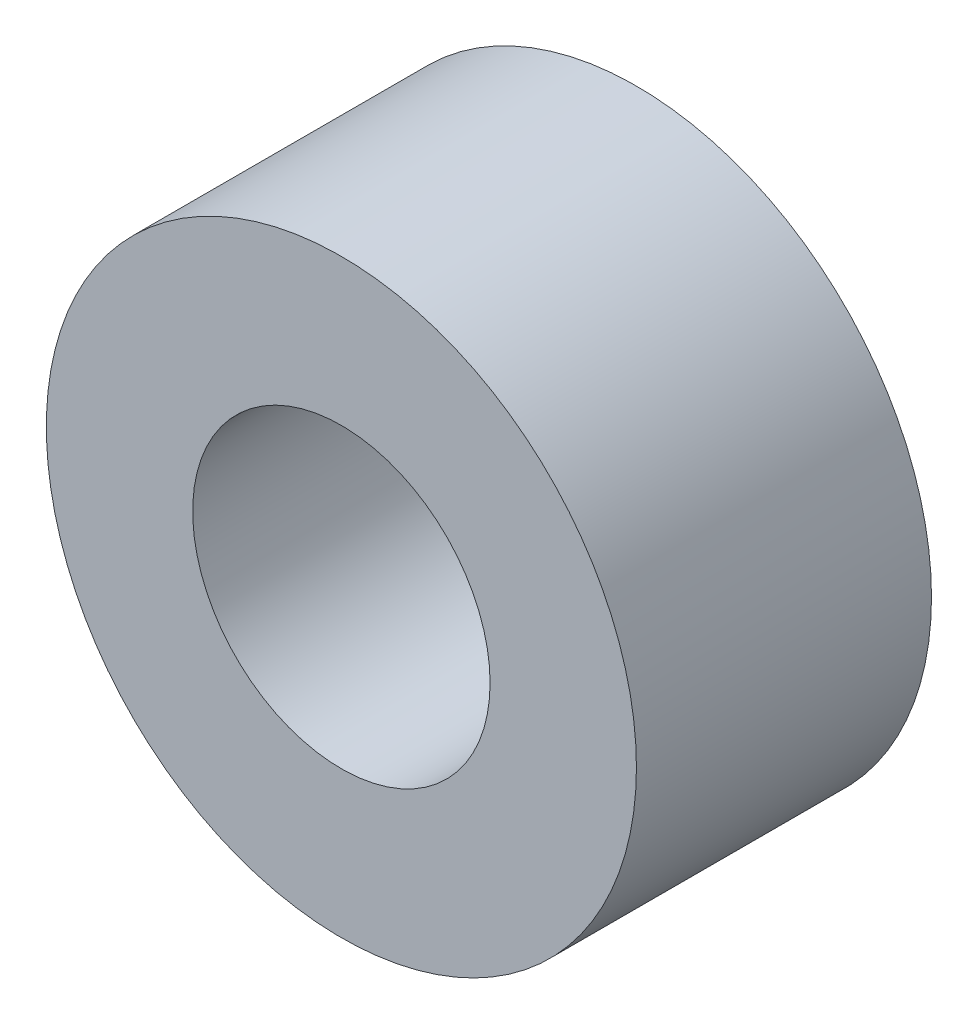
from build123d import *

# Parameters (mm, degrees)
EXTRUDE1_DEPTH      = 3.175
EXTRUDE1_DEPTH_BACK = 3.175
SKETCH1_R           = 6.35
SKETCH1_R_2         = 3.2004


with BuildPart() as part:
    # Sketch1 → Extrude1 (new, two sides: drawn at the far end of the back side and taken through both)
    with BuildSketch(Plane.XY.offset(-EXTRUDE1_DEPTH_BACK)):
        Circle(SKETCH1_R)
        Circle(SKETCH1_R_2, mode=Mode.SUBTRACT)
    extrude(amount=EXTRUDE1_DEPTH + EXTRUDE1_DEPTH_BACK)


solid = part.part
